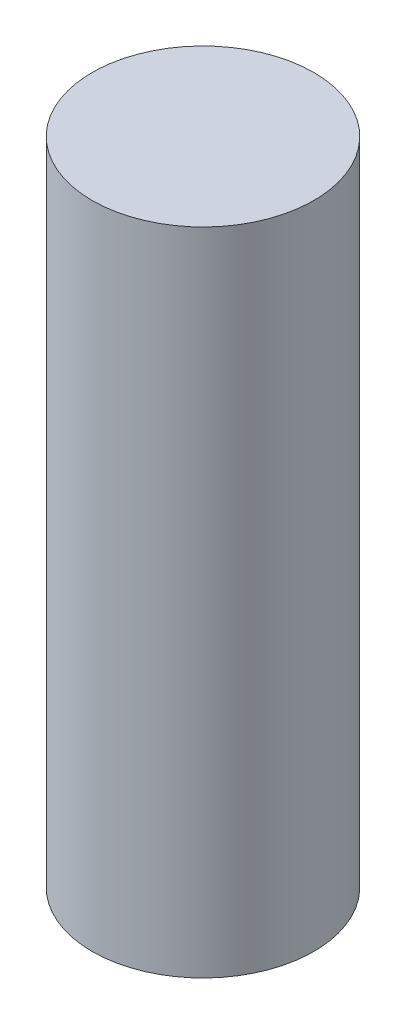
ISO-10303-21;
HEADER;
FILE_DESCRIPTION(('STEP AP214'),'2;1');
FILE_NAME('part.step','',(''),(''),'','','');
FILE_SCHEMA(('AUTOMOTIVE_DESIGN { 1 0 10303 214 1 1 1 1 }'));
ENDSEC;
DATA;
#1=APPLICATION_CONTEXT('core data for automotive mechanical design processes');
#2=APPLICATION_PROTOCOL_DEFINITION('international standard','automotive_design',2000,#1);
#3=PRODUCT_CONTEXT('',#1,'mechanical');
#4=PRODUCT('Part','Part','',(#3));
#5=PRODUCT_RELATED_PRODUCT_CATEGORY('part','',(#4));
#6=PRODUCT_DEFINITION_FORMATION('','',#4);
#7=PRODUCT_DEFINITION_CONTEXT('part definition',#1,'design');
#8=PRODUCT_DEFINITION('design','',#6,#7);
#9=PRODUCT_DEFINITION_SHAPE('','',#8);
#10=(LENGTH_UNIT() NAMED_UNIT(*) SI_UNIT(.MILLI.,.METRE.));
#11=(NAMED_UNIT(*) PLANE_ANGLE_UNIT() SI_UNIT($,.RADIAN.));
#12=(NAMED_UNIT(*) SI_UNIT($,.STERADIAN.) SOLID_ANGLE_UNIT());
#13=UNCERTAINTY_MEASURE_WITH_UNIT(LENGTH_MEASURE(1.E-05),#10,'distance_accuracy_value','');
#14=(GEOMETRIC_REPRESENTATION_CONTEXT(3) GLOBAL_UNCERTAINTY_ASSIGNED_CONTEXT((#13)) GLOBAL_UNIT_ASSIGNED_CONTEXT((#10,
#11,#12)) REPRESENTATION_CONTEXT('',''));
#15=CARTESIAN_POINT('',(0.,0.,0.));
#16=DIRECTION('',(0.,0.,1.));
#17=DIRECTION('',(1.,0.,0.));
#18=AXIS2_PLACEMENT_3D('',#15,#16,#17);
#19=CARTESIAN_POINT('',(0.,55.88,0.));
#20=DIRECTION('',(0.,-1.,0.));
#21=DIRECTION('',(0.,0.,-1.));
#22=AXIS2_PLACEMENT_3D('',#19,#20,#21);
#23=CYLINDRICAL_SURFACE('',#22,9.525);
#24=CARTESIAN_POINT('',(0.,55.88,0.));
#25=DIRECTION('',(0.,1.,0.));
#26=DIRECTION('',(0.,0.,1.));
#27=AXIS2_PLACEMENT_3D('',#24,#25,#26);
#28=CIRCLE('',#27,9.525);
#29=CARTESIAN_POINT('',(0.,55.88,9.525));
#30=VERTEX_POINT('',#29);
#31=EDGE_CURVE('E10',#30,#30,#28,.T.);
#32=ORIENTED_EDGE('',*,*,#31,.F.);
#33=EDGE_LOOP('',(#32));
#34=FACE_BOUND('',#33,.T.);
#35=CARTESIAN_POINT('',(0.,0.,0.));
#36=DIRECTION('',(0.,1.,0.));
#37=DIRECTION('',(0.,0.,1.));
#38=AXIS2_PLACEMENT_3D('',#35,#36,#37);
#39=CIRCLE('',#38,9.525);
#40=CARTESIAN_POINT('',(0.,0.,9.525));
#41=VERTEX_POINT('',#40);
#42=EDGE_CURVE('E32',#41,#41,#39,.T.);
#43=ORIENTED_EDGE('',*,*,#42,.T.);
#44=EDGE_LOOP('',(#43));
#45=FACE_BOUND('',#44,.T.);
#46=ADVANCED_FACE('F29',(#34,#45),#23,.T.);
#47=CARTESIAN_POINT('',(0.,55.88,0.));
#48=DIRECTION('',(0.,1.,0.));
#49=DIRECTION('',(0.,0.,1.));
#50=AXIS2_PLACEMENT_3D('',#47,#48,#49);
#51=PLANE('',#50);
#52=ORIENTED_EDGE('',*,*,#31,.T.);
#53=EDGE_LOOP('',(#52));
#54=FACE_BOUND('',#53,.T.);
#55=ADVANCED_FACE('F44',(#54),#51,.T.);
#56=CARTESIAN_POINT('',(0.,0.,0.));
#57=DIRECTION('',(0.,1.,0.));
#58=DIRECTION('',(0.,0.,1.));
#59=AXIS2_PLACEMENT_3D('',#56,#57,#58);
#60=PLANE('',#59);
#61=ORIENTED_EDGE('',*,*,#42,.F.);
#62=EDGE_LOOP('',(#61));
#63=FACE_BOUND('',#62,.T.);
#64=ADVANCED_FACE('F42',(#63),#60,.F.);
#65=CLOSED_SHELL('',(#46,#55,#64));
#66=MANIFOLD_SOLID_BREP('B2',#65);
#67=ADVANCED_BREP_SHAPE_REPRESENTATION('',(#18,#66),#14);
#68=SHAPE_DEFINITION_REPRESENTATION(#9,#67);
ENDSEC;
END-ISO-10303-21;
